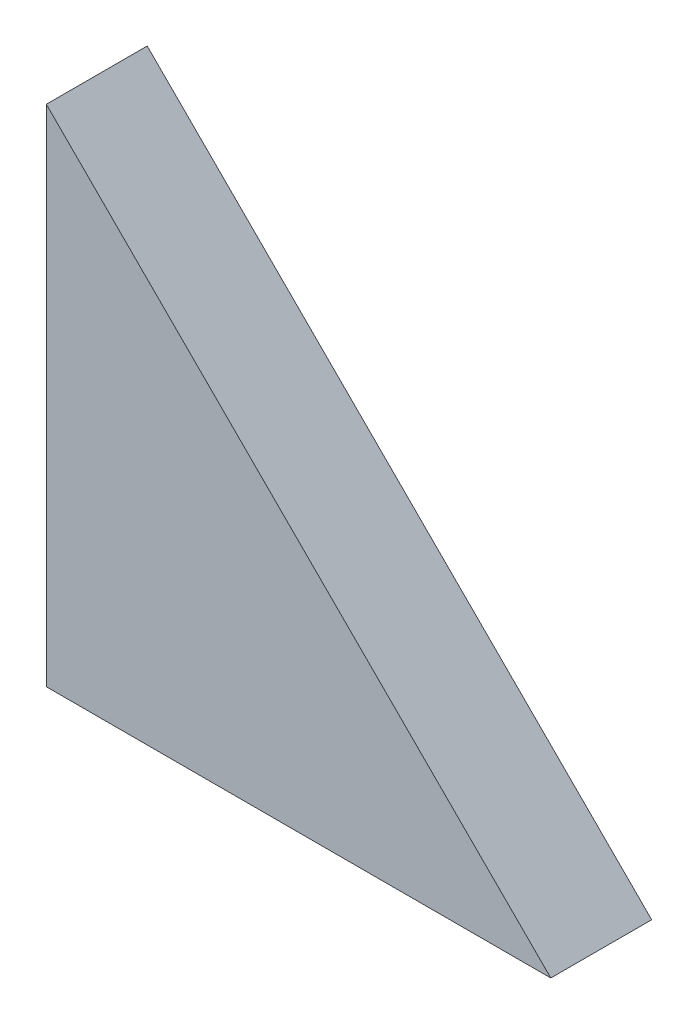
ISO-10303-21;
HEADER;
FILE_DESCRIPTION(('STEP AP214'),'2;1');
FILE_NAME('part.step','',(''),(''),'','','');
FILE_SCHEMA(('AUTOMOTIVE_DESIGN { 1 0 10303 214 1 1 1 1 }'));
ENDSEC;
DATA;
#1=APPLICATION_CONTEXT('core data for automotive mechanical design processes');
#2=APPLICATION_PROTOCOL_DEFINITION('international standard','automotive_design',2000,#1);
#3=PRODUCT_CONTEXT('',#1,'mechanical');
#4=PRODUCT('Part','Part','',(#3));
#5=PRODUCT_RELATED_PRODUCT_CATEGORY('part','',(#4));
#6=PRODUCT_DEFINITION_FORMATION('','',#4);
#7=PRODUCT_DEFINITION_CONTEXT('part definition',#1,'design');
#8=PRODUCT_DEFINITION('design','',#6,#7);
#9=PRODUCT_DEFINITION_SHAPE('','',#8);
#10=(LENGTH_UNIT() NAMED_UNIT(*) SI_UNIT(.MILLI.,.METRE.));
#11=(NAMED_UNIT(*) PLANE_ANGLE_UNIT() SI_UNIT($,.RADIAN.));
#12=(NAMED_UNIT(*) SI_UNIT($,.STERADIAN.) SOLID_ANGLE_UNIT());
#13=UNCERTAINTY_MEASURE_WITH_UNIT(LENGTH_MEASURE(1.E-05),#10,'distance_accuracy_value','');
#14=(GEOMETRIC_REPRESENTATION_CONTEXT(3) GLOBAL_UNCERTAINTY_ASSIGNED_CONTEXT((#13)) GLOBAL_UNIT_ASSIGNED_CONTEXT((#10,
#11,#12)) REPRESENTATION_CONTEXT('',''));
#15=CARTESIAN_POINT('',(0.,0.,0.));
#16=DIRECTION('',(0.,0.,1.));
#17=DIRECTION('',(1.,0.,0.));
#18=AXIS2_PLACEMENT_3D('',#15,#16,#17);
#19=CARTESIAN_POINT('',(21.213203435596,21.213203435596,12.));
#20=DIRECTION('',(0.,0.,1.));
#21=DIRECTION('',(1.,0.,0.));
#22=AXIS2_PLACEMENT_3D('',#19,#20,#21);
#23=PLANE('',#22);
#24=DIRECTION('',(1.,0.,0.));
#25=VECTOR('',#24,1.);
#26=CARTESIAN_POINT('',(0.,0.,12.));
#27=LINE('',#26,#25);
#28=CARTESIAN_POINT('',(0.,0.,12.));
#29=VERTEX_POINT('',#28);
#30=CARTESIAN_POINT('',(60.,0.,12.));
#31=VERTEX_POINT('',#30);
#32=EDGE_CURVE('E72',#29,#31,#27,.T.);
#33=ORIENTED_EDGE('',*,*,#32,.T.);
#34=DIRECTION('',(-0.707106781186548,0.707106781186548,0.));
#35=VECTOR('',#34,1.);
#36=CARTESIAN_POINT('',(60.,0.,12.));
#37=LINE('',#36,#35);
#38=CARTESIAN_POINT('',(0.,60.,12.));
#39=VERTEX_POINT('',#38);
#40=EDGE_CURVE('E65',#31,#39,#37,.T.);
#41=ORIENTED_EDGE('',*,*,#40,.T.);
#42=DIRECTION('',(0.,-1.,0.));
#43=VECTOR('',#42,1.);
#44=CARTESIAN_POINT('',(0.,60.,12.));
#45=LINE('',#44,#43);
#46=EDGE_CURVE('E10',#39,#29,#45,.T.);
#47=ORIENTED_EDGE('',*,*,#46,.T.);
#48=EDGE_LOOP('',(#33,#41,#47));
#49=FACE_BOUND('',#48,.T.);
#50=ADVANCED_FACE('F16',(#49),#23,.T.);
#51=CARTESIAN_POINT('',(21.213203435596,21.213203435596,0.));
#52=DIRECTION('',(0.,0.,1.));
#53=DIRECTION('',(1.,0.,0.));
#54=AXIS2_PLACEMENT_3D('',#51,#52,#53);
#55=PLANE('',#54);
#56=DIRECTION('',(0.,-1.,0.));
#57=VECTOR('',#56,1.);
#58=CARTESIAN_POINT('',(0.,60.,0.));
#59=LINE('',#58,#57);
#60=CARTESIAN_POINT('',(0.,60.,0.));
#61=VERTEX_POINT('',#60);
#62=CARTESIAN_POINT('',(0.,0.,0.));
#63=VERTEX_POINT('',#62);
#64=EDGE_CURVE('E20',#61,#63,#59,.T.);
#65=ORIENTED_EDGE('',*,*,#64,.F.);
#66=DIRECTION('',(-0.707106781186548,0.707106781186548,0.));
#67=VECTOR('',#66,1.);
#68=CARTESIAN_POINT('',(60.,0.,0.));
#69=LINE('',#68,#67);
#70=CARTESIAN_POINT('',(60.,0.,0.));
#71=VERTEX_POINT('',#70);
#72=EDGE_CURVE('E74',#71,#61,#69,.T.);
#73=ORIENTED_EDGE('',*,*,#72,.F.);
#74=DIRECTION('',(1.,0.,0.));
#75=VECTOR('',#74,1.);
#76=CARTESIAN_POINT('',(0.,0.,0.));
#77=LINE('',#76,#75);
#78=EDGE_CURVE('E70',#63,#71,#77,.T.);
#79=ORIENTED_EDGE('',*,*,#78,.F.);
#80=EDGE_LOOP('',(#65,#73,#79));
#81=FACE_BOUND('',#80,.T.);
#82=ADVANCED_FACE('F18',(#81),#55,.F.);
#83=CARTESIAN_POINT('',(0.,60.,0.));
#84=DIRECTION('',(1.,0.,0.));
#85=DIRECTION('',(0.,1.,0.));
#86=AXIS2_PLACEMENT_3D('',#83,#84,#85);
#87=PLANE('',#86);
#88=ORIENTED_EDGE('',*,*,#64,.T.);
#89=DIRECTION('',(0.,0.,1.));
#90=VECTOR('',#89,1.);
#91=CARTESIAN_POINT('',(0.,0.,0.));
#92=LINE('',#91,#90);
#93=EDGE_CURVE('E57',#63,#29,#92,.T.);
#94=ORIENTED_EDGE('',*,*,#93,.T.);
#95=ORIENTED_EDGE('',*,*,#46,.F.);
#96=DIRECTION('',(0.,0.,1.));
#97=VECTOR('',#96,1.);
#98=CARTESIAN_POINT('',(0.,60.,0.));
#99=LINE('',#98,#97);
#100=EDGE_CURVE('E60',#61,#39,#99,.T.);
#101=ORIENTED_EDGE('',*,*,#100,.F.);
#102=EDGE_LOOP('',(#88,#94,#95,#101));
#103=FACE_BOUND('',#102,.T.);
#104=ADVANCED_FACE('F56',(#103),#87,.F.);
#105=CARTESIAN_POINT('',(60.,0.,0.));
#106=DIRECTION('',(-0.707106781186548,-0.707106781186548,0.));
#107=DIRECTION('',(-0.707106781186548,0.707106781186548,0.));
#108=AXIS2_PLACEMENT_3D('',#105,#106,#107);
#109=PLANE('',#108);
#110=ORIENTED_EDGE('',*,*,#72,.T.);
#111=ORIENTED_EDGE('',*,*,#100,.T.);
#112=ORIENTED_EDGE('',*,*,#40,.F.);
#113=DIRECTION('',(0.,0.,1.));
#114=VECTOR('',#113,1.);
#115=CARTESIAN_POINT('',(60.,0.,0.));
#116=LINE('',#115,#114);
#117=EDGE_CURVE('E78',#71,#31,#116,.T.);
#118=ORIENTED_EDGE('',*,*,#117,.F.);
#119=EDGE_LOOP('',(#110,#111,#112,#118));
#120=FACE_BOUND('',#119,.T.);
#121=ADVANCED_FACE('F93',(#120),#109,.F.);
#122=CARTESIAN_POINT('',(0.,0.,0.));
#123=DIRECTION('',(0.,1.,0.));
#124=DIRECTION('',(1.,0.,0.));
#125=AXIS2_PLACEMENT_3D('',#122,#123,#124);
#126=PLANE('',#125);
#127=ORIENTED_EDGE('',*,*,#78,.T.);
#128=ORIENTED_EDGE('',*,*,#117,.T.);
#129=ORIENTED_EDGE('',*,*,#32,.F.);
#130=ORIENTED_EDGE('',*,*,#93,.F.);
#131=EDGE_LOOP('',(#127,#128,#129,#130));
#132=FACE_BOUND('',#131,.T.);
#133=ADVANCED_FACE('F68',(#132),#126,.F.);
#134=CLOSED_SHELL('',(#50,#82,#104,#121,#133));
#135=MANIFOLD_SOLID_BREP('B1',#134);
#136=ADVANCED_BREP_SHAPE_REPRESENTATION('',(#18,#135),#14);
#137=SHAPE_DEFINITION_REPRESENTATION(#9,#136);
ENDSEC;
END-ISO-10303-21;
